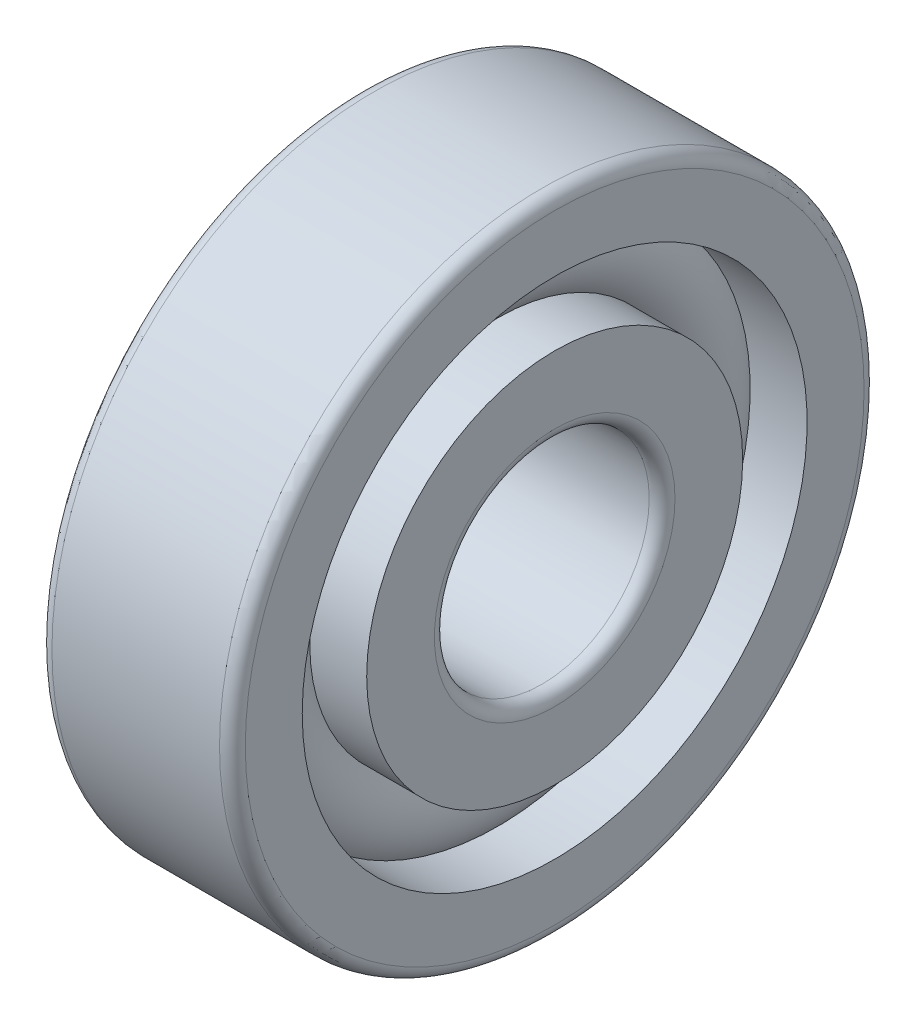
ISO-10303-21;
HEADER;
FILE_DESCRIPTION(('STEP AP214'),'2;1');
FILE_NAME('part.step','',(''),(''),'','','');
FILE_SCHEMA(('AUTOMOTIVE_DESIGN { 1 0 10303 214 1 1 1 1 }'));
ENDSEC;
DATA;
#1=APPLICATION_CONTEXT('core data for automotive mechanical design processes');
#2=APPLICATION_PROTOCOL_DEFINITION('international standard','automotive_design',2000,#1);
#3=PRODUCT_CONTEXT('',#1,'mechanical');
#4=PRODUCT('Part','Part','',(#3));
#5=PRODUCT_RELATED_PRODUCT_CATEGORY('part','',(#4));
#6=PRODUCT_DEFINITION_FORMATION('','',#4);
#7=PRODUCT_DEFINITION_CONTEXT('part definition',#1,'design');
#8=PRODUCT_DEFINITION('design','',#6,#7);
#9=PRODUCT_DEFINITION_SHAPE('','',#8);
#10=(LENGTH_UNIT() NAMED_UNIT(*) SI_UNIT(.MILLI.,.METRE.));
#11=(NAMED_UNIT(*) PLANE_ANGLE_UNIT() SI_UNIT($,.RADIAN.));
#12=(NAMED_UNIT(*) SI_UNIT($,.STERADIAN.) SOLID_ANGLE_UNIT());
#13=UNCERTAINTY_MEASURE_WITH_UNIT(LENGTH_MEASURE(1.E-05),#10,'distance_accuracy_value','');
#14=(GEOMETRIC_REPRESENTATION_CONTEXT(3) GLOBAL_UNCERTAINTY_ASSIGNED_CONTEXT((#13)) GLOBAL_UNIT_ASSIGNED_CONTEXT((#10,
#11,#12)) REPRESENTATION_CONTEXT('',''));
#15=CARTESIAN_POINT('',(0.,0.,0.));
#16=DIRECTION('',(0.,0.,1.));
#17=DIRECTION('',(1.,0.,0.));
#18=AXIS2_PLACEMENT_3D('',#15,#16,#17);
#19=CARTESIAN_POINT('',(1.50259452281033,0.,0.));
#20=DIRECTION('',(1.,0.,0.));
#21=DIRECTION('',(0.,0.,-1.));
#22=AXIS2_PLACEMENT_3D('',#19,#20,#21);
#23=TOROIDAL_SURFACE('',#22,11.8499999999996,0.099999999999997);
#24=CARTESIAN_POINT('',(1.40297711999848,0.,0.));
#25=DIRECTION('',(-1.,0.,0.));
#26=DIRECTION('',(0.,0.,1.));
#27=AXIS2_PLACEMENT_3D('',#24,#25,#26);
#28=CIRCLE('',#27,11.8412608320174);
#29=CARTESIAN_POINT('',(1.40297711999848,0.,11.8412608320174));
#30=VERTEX_POINT('',#29);
#31=EDGE_CURVE('E491',#30,#30,#28,.T.);
#32=ORIENTED_EDGE('',*,*,#31,.T.);
#33=EDGE_LOOP('',(#32));
#34=FACE_BOUND('',#33,.T.);
#35=CARTESIAN_POINT('',(1.50259425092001,0.,0.));
#36=DIRECTION('',(-1.,0.,0.));
#37=DIRECTION('',(0.,0.,1.));
#38=AXIS2_PLACEMENT_3D('',#35,#36,#37);
#39=CIRCLE('',#38,11.75);
#40=CARTESIAN_POINT('',(1.50259425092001,0.,11.75));
#41=VERTEX_POINT('',#40);
#42=EDGE_CURVE('E488',#41,#41,#39,.F.);
#43=ORIENTED_EDGE('',*,*,#42,.T.);
#44=EDGE_LOOP('',(#43));
#45=FACE_BOUND('',#44,.T.);
#46=ADVANCED_FACE('F14',(#34,#45),#23,.T.);
#47=CARTESIAN_POINT('',(1.383,0.,0.));
#48=DIRECTION('',(-1.,0.,0.));
#49=DIRECTION('',(0.,0.,1.));
#50=AXIS2_PLACEMENT_3D('',#47,#48,#49);
#51=CONICAL_SURFACE('',#50,12.069,1.48330098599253);
#52=CARTESIAN_POINT('',(1.383,0.,0.));
#53=DIRECTION('',(-1.,0.,0.));
#54=DIRECTION('',(0.,0.,1.));
#55=AXIS2_PLACEMENT_3D('',#52,#53,#54);
#56=CIRCLE('',#55,12.069);
#57=CARTESIAN_POINT('',(1.383,0.,12.069));
#58=VERTEX_POINT('',#57);
#59=EDGE_CURVE('E18',#58,#58,#56,.F.);
#60=ORIENTED_EDGE('',*,*,#59,.F.);
#61=EDGE_LOOP('',(#60));
#62=FACE_BOUND('',#61,.T.);
#63=ORIENTED_EDGE('',*,*,#31,.F.);
#64=EDGE_LOOP('',(#63));
#65=FACE_BOUND('',#64,.T.);
#66=ADVANCED_FACE('F426',(#62,#65),#51,.F.);
#67=CARTESIAN_POINT('',(8.4,0.,0.));
#68=DIRECTION('',(-1.,0.,0.));
#69=DIRECTION('',(0.,0.,1.));
#70=AXIS2_PLACEMENT_3D('',#67,#68,#69);
#71=CYLINDRICAL_SURFACE('',#70,11.75);
#72=ORIENTED_EDGE('',*,*,#42,.F.);
#73=EDGE_LOOP('',(#72));
#74=FACE_BOUND('',#73,.T.);
#75=CARTESIAN_POINT('',(2.65099999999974,0.,0.));
#76=DIRECTION('',(1.,0.,0.));
#77=DIRECTION('',(0.,0.,-1.));
#78=AXIS2_PLACEMENT_3D('',#75,#76,#77);
#79=CIRCLE('',#78,11.75);
#80=CARTESIAN_POINT('',(2.65099999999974,0.,-11.75));
#81=VERTEX_POINT('',#80);
#82=EDGE_CURVE('E411',#81,#81,#79,.F.);
#83=ORIENTED_EDGE('',*,*,#82,.F.);
#84=EDGE_LOOP('',(#83));
#85=FACE_BOUND('',#84,.T.);
#86=ADVANCED_FACE('F423',(#74,#85),#71,.F.);
#87=CARTESIAN_POINT('',(1.383,11.6,0.));
#88=DIRECTION('',(1.,0.,0.));
#89=DIRECTION('',(0.,0.,-1.));
#90=AXIS2_PLACEMENT_3D('',#87,#88,#89);
#91=PLANE('',#90);
#92=CARTESIAN_POINT('',(1.383,0.,0.));
#93=DIRECTION('',(1.,0.,0.));
#94=DIRECTION('',(0.,0.,-1.));
#95=AXIS2_PLACEMENT_3D('',#92,#93,#94);
#96=CIRCLE('',#95,11.6);
#97=CARTESIAN_POINT('',(1.383,0.,-11.6));
#98=VERTEX_POINT('',#97);
#99=EDGE_CURVE('E406',#98,#98,#96,.F.);
#100=ORIENTED_EDGE('',*,*,#99,.T.);
#101=EDGE_LOOP('',(#100));
#102=FACE_BOUND('',#101,.T.);
#103=ORIENTED_EDGE('',*,*,#59,.T.);
#104=EDGE_LOOP('',(#103));
#105=FACE_BOUND('',#104,.T.);
#106=ADVANCED_FACE('F419',(#102,#105),#91,.T.);
#107=CARTESIAN_POINT('',(4.50009734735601,0.,0.));
#108=DIRECTION('',(1.,0.,0.));
#109=DIRECTION('',(0.,0.,-1.));
#110=AXIS2_PLACEMENT_3D('',#107,#108,#109);
#111=TOROIDAL_SURFACE('',#110,10.25,2.381);
#112=ORIENTED_EDGE('',*,*,#82,.T.);
#113=EDGE_LOOP('',(#112));
#114=FACE_BOUND('',#113,.T.);
#115=CARTESIAN_POINT('',(2.65099999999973,0.,0.));
#116=DIRECTION('',(-1.,0.,0.));
#117=DIRECTION('',(0.,0.,1.));
#118=AXIS2_PLACEMENT_3D('',#115,#116,#117);
#119=CIRCLE('',#118,8.75);
#120=CARTESIAN_POINT('',(2.65099999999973,0.,8.75));
#121=VERTEX_POINT('',#120);
#122=EDGE_CURVE('E403',#121,#121,#119,.T.);
#123=ORIENTED_EDGE('',*,*,#122,.F.);
#124=EDGE_LOOP('',(#123));
#125=FACE_BOUND('',#124,.T.);
#126=ADVANCED_FACE('F414',(#114,#125),#111,.T.);
#127=CARTESIAN_POINT('',(1.383,0.,0.));
#128=DIRECTION('',(1.,0.,0.));
#129=DIRECTION('',(0.,0.,-1.));
#130=AXIS2_PLACEMENT_3D('',#127,#128,#129);
#131=CONICAL_SURFACE('',#130,11.6,0.785398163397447);
#132=CARTESIAN_POINT('',(0.633000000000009,0.,0.));
#133=DIRECTION('',(1.,0.,0.));
#134=DIRECTION('',(0.,0.,-1.));
#135=AXIS2_PLACEMENT_3D('',#132,#133,#134);
#136=CIRCLE('',#135,10.85);
#137=CARTESIAN_POINT('',(0.633000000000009,0.,-10.85));
#138=VERTEX_POINT('',#137);
#139=EDGE_CURVE('E400',#138,#138,#136,.T.);
#140=ORIENTED_EDGE('',*,*,#139,.F.);
#141=EDGE_LOOP('',(#140));
#142=FACE_BOUND('',#141,.T.);
#143=ORIENTED_EDGE('',*,*,#99,.F.);
#144=EDGE_LOOP('',(#143));
#145=FACE_BOUND('',#144,.T.);
#146=ADVANCED_FACE('F418',(#142,#145),#131,.F.);
#147=CARTESIAN_POINT('',(8.4,0.,0.));
#148=DIRECTION('',(-1.,0.,0.));
#149=DIRECTION('',(0.,0.,1.));
#150=AXIS2_PLACEMENT_3D('',#147,#148,#149);
#151=CYLINDRICAL_SURFACE('',#150,8.75);
#152=ORIENTED_EDGE('',*,*,#122,.T.);
#153=EDGE_LOOP('',(#152));
#154=FACE_BOUND('',#153,.T.);
#155=CARTESIAN_POINT('',(1.63808545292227,0.,0.));
#156=DIRECTION('',(1.,0.,0.));
#157=DIRECTION('',(0.,0.,-1.));
#158=AXIS2_PLACEMENT_3D('',#155,#156,#157);
#159=CIRCLE('',#158,8.75000000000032);
#160=CARTESIAN_POINT('',(1.63808545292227,0.,-8.75000000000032));
#161=VERTEX_POINT('',#160);
#162=EDGE_CURVE('E396',#161,#161,#159,.F.);
#163=ORIENTED_EDGE('',*,*,#162,.F.);
#164=EDGE_LOOP('',(#163));
#165=FACE_BOUND('',#164,.T.);
#166=ADVANCED_FACE('F506',(#154,#165),#151,.T.);
#167=CARTESIAN_POINT('',(0.63300000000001,8.55,0.));
#168=DIRECTION('',(1.,0.,0.));
#169=DIRECTION('',(0.,0.,-1.));
#170=AXIS2_PLACEMENT_3D('',#167,#168,#169);
#171=PLANE('',#170);
#172=CARTESIAN_POINT('',(0.633000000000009,0.,0.));
#173=DIRECTION('',(-1.,0.,0.));
#174=DIRECTION('',(0.,0.,1.));
#175=AXIS2_PLACEMENT_3D('',#172,#173,#174);
#176=CIRCLE('',#175,8.55);
#177=CARTESIAN_POINT('',(0.633000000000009,0.,8.55));
#178=VERTEX_POINT('',#177);
#179=EDGE_CURVE('E399',#178,#178,#176,.F.);
#180=ORIENTED_EDGE('',*,*,#179,.F.);
#181=EDGE_LOOP('',(#180));
#182=FACE_BOUND('',#181,.T.);
#183=ORIENTED_EDGE('',*,*,#139,.T.);
#184=EDGE_LOOP('',(#183));
#185=FACE_BOUND('',#184,.T.);
#186=ADVANCED_FACE('F388',(#182,#185),#171,.T.);
#187=CARTESIAN_POINT('',(1.63808545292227,0.,0.));
#188=DIRECTION('',(1.,0.,0.));
#189=DIRECTION('',(0.,0.,-1.));
#190=AXIS2_PLACEMENT_3D('',#187,#188,#189);
#191=TOROIDAL_SURFACE('',#190,8.55000000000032,0.2);
#192=ORIENTED_EDGE('',*,*,#162,.T.);
#193=EDGE_LOOP('',(#192));
#194=FACE_BOUND('',#193,.T.);
#195=CARTESIAN_POINT('',(1.45012673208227,0.,0.));
#196=DIRECTION('',(1.,0.,0.));
#197=DIRECTION('',(0.,0.,-1.));
#198=AXIS2_PLACEMENT_3D('',#195,#196,#197);
#199=CIRCLE('',#198,8.61834851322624);
#200=CARTESIAN_POINT('',(1.45012673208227,0.,-8.61834851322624));
#201=VERTEX_POINT('',#200);
#202=EDGE_CURVE('E479',#201,#201,#199,.F.);
#203=ORIENTED_EDGE('',*,*,#202,.F.);
#204=EDGE_LOOP('',(#203));
#205=FACE_BOUND('',#204,.T.);
#206=ADVANCED_FACE('F383',(#194,#205),#191,.T.);
#207=CARTESIAN_POINT('',(8.4,0.,0.));
#208=DIRECTION('',(-1.,0.,0.));
#209=DIRECTION('',(0.,0.,1.));
#210=AXIS2_PLACEMENT_3D('',#207,#208,#209);
#211=CYLINDRICAL_SURFACE('',#210,8.55);
#212=CARTESIAN_POINT('',(1.083,0.,0.));
#213=DIRECTION('',(-1.,0.,0.));
#214=DIRECTION('',(0.,0.,1.));
#215=AXIS2_PLACEMENT_3D('',#212,#213,#214);
#216=CIRCLE('',#215,8.55);
#217=CARTESIAN_POINT('',(1.083,0.,8.55));
#218=VERTEX_POINT('',#217);
#219=EDGE_CURVE('E476',#218,#218,#216,.F.);
#220=ORIENTED_EDGE('',*,*,#219,.F.);
#221=EDGE_LOOP('',(#220));
#222=FACE_BOUND('',#221,.T.);
#223=ORIENTED_EDGE('',*,*,#179,.T.);
#224=EDGE_LOOP('',(#223));
#225=FACE_BOUND('',#224,.T.);
#226=ADVANCED_FACE('F379',(#222,#225),#211,.T.);
#227=CARTESIAN_POINT('',(1.45012673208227,0.,0.));
#228=DIRECTION('',(1.,0.,0.));
#229=DIRECTION('',(0.,1.,0.));
#230=AXIS2_PLACEMENT_3D('',#227,#228,#229);
#231=CONICAL_SURFACE('',#230,8.61834851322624,1.22202532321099);
#232=ORIENTED_EDGE('',*,*,#202,.T.);
#233=EDGE_LOOP('',(#232));
#234=FACE_BOUND('',#233,.T.);
#235=CARTESIAN_POINT('',(1.1822369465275,0.,0.));
#236=DIRECTION('',(1.,0.,0.));
#237=DIRECTION('',(0.,0.,-1.));
#238=AXIS2_PLACEMENT_3D('',#235,#236,#237);
#239=CIRCLE('',#238,7.88165160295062);
#240=CARTESIAN_POINT('',(1.1822369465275,0.,-7.88165160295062));
#241=VERTEX_POINT('',#240);
#242=EDGE_CURVE('E364',#241,#241,#239,.T.);
#243=ORIENTED_EDGE('',*,*,#242,.T.);
#244=EDGE_LOOP('',(#243));
#245=FACE_BOUND('',#244,.T.);
#246=ADVANCED_FACE('F375',(#234,#245),#231,.T.);
#247=CARTESIAN_POINT('',(1.083,8.35,0.));
#248=DIRECTION('',(1.,0.,0.));
#249=DIRECTION('',(0.,0.,-1.));
#250=AXIS2_PLACEMENT_3D('',#247,#248,#249);
#251=PLANE('',#250);
#252=CARTESIAN_POINT('',(1.083,0.,0.));
#253=DIRECTION('',(-1.,0.,0.));
#254=DIRECTION('',(0.,0.,1.));
#255=AXIS2_PLACEMENT_3D('',#252,#253,#254);
#256=CIRCLE('',#255,8.35);
#257=CARTESIAN_POINT('',(1.083,0.,8.35));
#258=VERTEX_POINT('',#257);
#259=EDGE_CURVE('E359',#258,#258,#256,.T.);
#260=ORIENTED_EDGE('',*,*,#259,.T.);
#261=EDGE_LOOP('',(#260));
#262=FACE_BOUND('',#261,.T.);
#263=ORIENTED_EDGE('',*,*,#219,.T.);
#264=EDGE_LOOP('',(#263));
#265=FACE_BOUND('',#264,.T.);
#266=ADVANCED_FACE('F371',(#262,#265),#251,.T.);
#267=CARTESIAN_POINT('',(0.994278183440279,0.,0.));
#268=DIRECTION('',(1.,0.,0.));
#269=DIRECTION('',(0.,0.,-1.));
#270=AXIS2_PLACEMENT_3D('',#267,#268,#269);
#271=TOROIDAL_SURFACE('',#270,7.94999999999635,0.2);
#272=CARTESIAN_POINT('',(0.994279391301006,0.,0.));
#273=DIRECTION('',(-1.,0.,0.));
#274=DIRECTION('',(0.,0.,1.));
#275=AXIS2_PLACEMENT_3D('',#272,#273,#274);
#276=CIRCLE('',#275,7.75);
#277=CARTESIAN_POINT('',(0.994279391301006,0.,7.75));
#278=VERTEX_POINT('',#277);
#279=EDGE_CURVE('E346',#278,#278,#276,.T.);
#280=ORIENTED_EDGE('',*,*,#279,.F.);
#281=EDGE_LOOP('',(#280));
#282=FACE_BOUND('',#281,.T.);
#283=ORIENTED_EDGE('',*,*,#242,.F.);
#284=EDGE_LOOP('',(#283));
#285=FACE_BOUND('',#284,.T.);
#286=ADVANCED_FACE('F367',(#282,#285),#271,.F.);
#287=CARTESIAN_POINT('',(8.4,0.,0.));
#288=DIRECTION('',(-1.,0.,0.));
#289=DIRECTION('',(0.,0.,1.));
#290=AXIS2_PLACEMENT_3D('',#287,#288,#289);
#291=CYLINDRICAL_SURFACE('',#290,8.35);
#292=CARTESIAN_POINT('',(0.633000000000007,0.,0.));
#293=DIRECTION('',(1.,0.,0.));
#294=DIRECTION('',(0.,0.,-1.));
#295=AXIS2_PLACEMENT_3D('',#292,#293,#294);
#296=CIRCLE('',#295,8.35);
#297=CARTESIAN_POINT('',(0.633000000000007,0.,-8.35));
#298=VERTEX_POINT('',#297);
#299=EDGE_CURVE('E342',#298,#298,#296,.T.);
#300=ORIENTED_EDGE('',*,*,#299,.F.);
#301=EDGE_LOOP('',(#300));
#302=FACE_BOUND('',#301,.T.);
#303=ORIENTED_EDGE('',*,*,#259,.F.);
#304=EDGE_LOOP('',(#303));
#305=FACE_BOUND('',#304,.T.);
#306=ADVANCED_FACE('F370',(#302,#305),#291,.F.);
#307=CARTESIAN_POINT('',(8.4,0.,0.));
#308=DIRECTION('',(-1.,0.,0.));
#309=DIRECTION('',(0.,0.,1.));
#310=AXIS2_PLACEMENT_3D('',#307,#308,#309);
#311=CYLINDRICAL_SURFACE('',#310,7.75);
#312=ORIENTED_EDGE('',*,*,#279,.T.);
#313=EDGE_LOOP('',(#312));
#314=FACE_BOUND('',#313,.T.);
#315=CARTESIAN_POINT('',(0.928836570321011,0.,0.));
#316=DIRECTION('',(1.,0.,0.));
#317=DIRECTION('',(0.,0.,-1.));
#318=AXIS2_PLACEMENT_3D('',#315,#316,#317);
#319=CIRCLE('',#318,7.75);
#320=CARTESIAN_POINT('',(0.928836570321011,0.,-7.75));
#321=VERTEX_POINT('',#320);
#322=EDGE_CURVE('E345',#321,#321,#319,.T.);
#323=ORIENTED_EDGE('',*,*,#322,.T.);
#324=EDGE_LOOP('',(#323));
#325=FACE_BOUND('',#324,.T.);
#326=ADVANCED_FACE('F334',(#314,#325),#311,.T.);
#327=CARTESIAN_POINT('',(0.633000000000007,0.,0.));
#328=DIRECTION('',(1.,0.,0.));
#329=DIRECTION('',(0.,0.,-1.));
#330=AXIS2_PLACEMENT_3D('',#327,#328,#329);
#331=TOROIDAL_SURFACE('',#330,8.55,0.2);
#332=CARTESIAN_POINT('',(0.433000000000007,0.,0.));
#333=DIRECTION('',(-1.,0.,0.));
#334=DIRECTION('',(0.,0.,-1.));
#335=AXIS2_PLACEMENT_3D('',#332,#333,#334);
#336=CIRCLE('',#335,8.55);
#337=CARTESIAN_POINT('',(0.433000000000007,0.,-8.55));
#338=VERTEX_POINT('',#337);
#339=EDGE_CURVE('E299',#338,#338,#336,.F.);
#340=ORIENTED_EDGE('',*,*,#339,.F.);
#341=EDGE_LOOP('',(#340));
#342=FACE_BOUND('',#341,.T.);
#343=ORIENTED_EDGE('',*,*,#299,.T.);
#344=EDGE_LOOP('',(#343));
#345=FACE_BOUND('',#344,.T.);
#346=ADVANCED_FACE('F328',(#342,#345),#331,.T.);
#347=CARTESIAN_POINT('',(0.92883769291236,0.,0.));
#348=DIRECTION('',(1.,0.,0.));
#349=DIRECTION('',(0.,0.,-1.));
#350=AXIS2_PLACEMENT_3D('',#347,#348,#349);
#351=TOROIDAL_SURFACE('',#350,7.94999999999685,0.199999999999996);
#352=CARTESIAN_POINT('',(0.775613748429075,0.,0.));
#353=DIRECTION('',(-1.,0.,0.));
#354=DIRECTION('',(0.,0.,1.));
#355=AXIS2_PLACEMENT_3D('',#352,#353,#354);
#356=CIRCLE('',#355,7.82146042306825);
#357=CARTESIAN_POINT('',(0.775613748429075,0.,7.82146042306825));
#358=VERTEX_POINT('',#357);
#359=EDGE_CURVE('E296',#358,#358,#356,.T.);
#360=ORIENTED_EDGE('',*,*,#359,.F.);
#361=EDGE_LOOP('',(#360));
#362=FACE_BOUND('',#361,.T.);
#363=ORIENTED_EDGE('',*,*,#322,.F.);
#364=EDGE_LOOP('',(#363));
#365=FACE_BOUND('',#364,.T.);
#366=ADVANCED_FACE('F323',(#362,#365),#351,.F.);
#367=CARTESIAN_POINT('',(0.433000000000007,10.933,0.));
#368=DIRECTION('',(-1.,0.,0.));
#369=DIRECTION('',(0.,0.,1.));
#370=AXIS2_PLACEMENT_3D('',#367,#368,#369);
#371=PLANE('',#370);
#372=CARTESIAN_POINT('',(0.433000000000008,0.,0.));
#373=DIRECTION('',(1.,0.,0.));
#374=DIRECTION('',(0.,0.,-1.));
#375=AXIS2_PLACEMENT_3D('',#372,#373,#374);
#376=CIRCLE('',#375,10.933);
#377=CARTESIAN_POINT('',(0.433000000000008,0.,-10.933));
#378=VERTEX_POINT('',#377);
#379=EDGE_CURVE('E293',#378,#378,#376,.T.);
#380=ORIENTED_EDGE('',*,*,#379,.F.);
#381=EDGE_LOOP('',(#380));
#382=FACE_BOUND('',#381,.T.);
#383=ORIENTED_EDGE('',*,*,#339,.T.);
#384=EDGE_LOOP('',(#383));
#385=FACE_BOUND('',#384,.T.);
#386=ADVANCED_FACE('F312',(#382,#385),#371,.T.);
#387=CARTESIAN_POINT('',(0.5,0.,0.));
#388=DIRECTION('',(-1.,0.,0.));
#389=DIRECTION('',(0.,-1.,0.));
#390=AXIS2_PLACEMENT_3D('',#387,#388,#389);
#391=CONICAL_SURFACE('',#390,8.15,0.872778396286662);
#392=ORIENTED_EDGE('',*,*,#359,.T.);
#393=EDGE_LOOP('',(#392));
#394=FACE_BOUND('',#393,.T.);
#395=CARTESIAN_POINT('',(0.5,0.,0.));
#396=DIRECTION('',(-1.,0.,0.));
#397=DIRECTION('',(0.,0.,1.));
#398=AXIS2_PLACEMENT_3D('',#395,#396,#397);
#399=CIRCLE('',#398,8.15);
#400=CARTESIAN_POINT('',(0.5,0.,8.15));
#401=VERTEX_POINT('',#400);
#402=EDGE_CURVE('E288',#401,#401,#399,.T.);
#403=ORIENTED_EDGE('',*,*,#402,.F.);
#404=EDGE_LOOP('',(#403));
#405=FACE_BOUND('',#404,.T.);
#406=ADVANCED_FACE('F322',(#394,#405),#391,.T.);
#407=CARTESIAN_POINT('',(1.183,0.,0.));
#408=DIRECTION('',(1.,0.,0.));
#409=DIRECTION('',(0.,0.,-1.));
#410=AXIS2_PLACEMENT_3D('',#407,#408,#409);
#411=CONICAL_SURFACE('',#410,11.683,0.785398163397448);
#412=CARTESIAN_POINT('',(1.183,0.,0.));
#413=DIRECTION('',(-1.,0.,0.));
#414=DIRECTION('',(0.,0.,1.));
#415=AXIS2_PLACEMENT_3D('',#412,#413,#414);
#416=CIRCLE('',#415,11.683);
#417=CARTESIAN_POINT('',(1.183,0.,11.683));
#418=VERTEX_POINT('',#417);
#419=EDGE_CURVE('E271',#418,#418,#416,.T.);
#420=ORIENTED_EDGE('',*,*,#419,.T.);
#421=EDGE_LOOP('',(#420));
#422=FACE_BOUND('',#421,.T.);
#423=ORIENTED_EDGE('',*,*,#379,.T.);
#424=EDGE_LOOP('',(#423));
#425=FACE_BOUND('',#424,.T.);
#426=ADVANCED_FACE('F684',(#422,#425),#411,.T.);
#427=CARTESIAN_POINT('',(8.4,0.,0.));
#428=DIRECTION('',(-1.,0.,0.));
#429=DIRECTION('',(0.,0.,1.));
#430=AXIS2_PLACEMENT_3D('',#427,#428,#429);
#431=CYLINDRICAL_SURFACE('',#430,8.15);
#432=ORIENTED_EDGE('',*,*,#402,.T.);
#433=EDGE_LOOP('',(#432));
#434=FACE_BOUND('',#433,.T.);
#435=CARTESIAN_POINT('',(0.2,0.,0.));
#436=DIRECTION('',(1.,0.,0.));
#437=DIRECTION('',(0.,0.,-1.));
#438=AXIS2_PLACEMENT_3D('',#435,#436,#437);
#439=CIRCLE('',#438,8.15);
#440=CARTESIAN_POINT('',(0.2,0.,-8.15));
#441=VERTEX_POINT('',#440);
#442=EDGE_CURVE('E268',#441,#441,#439,.F.);
#443=ORIENTED_EDGE('',*,*,#442,.F.);
#444=EDGE_LOOP('',(#443));
#445=FACE_BOUND('',#444,.T.);
#446=ADVANCED_FACE('F674',(#434,#445),#431,.T.);
#447=CARTESIAN_POINT('',(1.13998897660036,0.,0.));
#448=DIRECTION('',(-1.,0.,0.));
#449=DIRECTION('',(0.,0.,1.));
#450=AXIS2_PLACEMENT_3D('',#447,#448,#449);
#451=CONICAL_SURFACE('',#450,12.5602248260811,1.52180477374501);
#452=CARTESIAN_POINT('',(1.13998897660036,0.,0.));
#453=DIRECTION('',(1.,0.,0.));
#454=DIRECTION('',(0.,0.,-1.));
#455=AXIS2_PLACEMENT_3D('',#452,#453,#454);
#456=CIRCLE('',#455,12.5602248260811);
#457=CARTESIAN_POINT('',(1.13998897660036,0.,-12.5602248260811));
#458=VERTEX_POINT('',#457);
#459=EDGE_CURVE('E247',#458,#458,#456,.F.);
#460=ORIENTED_EDGE('',*,*,#459,.T.);
#461=EDGE_LOOP('',(#460));
#462=FACE_BOUND('',#461,.T.);
#463=ORIENTED_EDGE('',*,*,#419,.F.);
#464=EDGE_LOOP('',(#463));
#465=FACE_BOUND('',#464,.T.);
#466=ADVANCED_FACE('F261',(#462,#465),#451,.F.);
#467=CARTESIAN_POINT('',(0.2,0.,0.));
#468=DIRECTION('',(1.,0.,0.));
#469=DIRECTION('',(0.,0.,-1.));
#470=AXIS2_PLACEMENT_3D('',#467,#468,#469);
#471=TOROIDAL_SURFACE('',#470,7.95,0.2);
#472=ORIENTED_EDGE('',*,*,#442,.T.);
#473=EDGE_LOOP('',(#472));
#474=FACE_BOUND('',#473,.T.);
#475=CARTESIAN_POINT('',(0.,0.,0.));
#476=DIRECTION('',(1.,0.,0.));
#477=DIRECTION('',(0.,0.,-1.));
#478=AXIS2_PLACEMENT_3D('',#475,#476,#477);
#479=CIRCLE('',#478,7.95000000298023);
#480=CARTESIAN_POINT('',(0.,0.,-7.95000000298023));
#481=VERTEX_POINT('',#480);
#482=EDGE_CURVE('E277',#481,#481,#479,.F.);
#483=ORIENTED_EDGE('',*,*,#482,.F.);
#484=EDGE_LOOP('',(#483));
#485=FACE_BOUND('',#484,.T.);
#486=ADVANCED_FACE('F254',(#474,#485),#471,.T.);
#487=CARTESIAN_POINT('',(1.04010919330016,0.,0.));
#488=DIRECTION('',(1.,0.,0.));
#489=DIRECTION('',(0.,0.,-1.));
#490=AXIS2_PLACEMENT_3D('',#487,#488,#489);
#491=TOROIDAL_SURFACE('',#490,12.5553228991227,0.1);
#492=ORIENTED_EDGE('',*,*,#459,.F.);
#493=EDGE_LOOP('',(#492));
#494=FACE_BOUND('',#493,.T.);
#495=CARTESIAN_POINT('',(0.96350055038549,0.,0.));
#496=DIRECTION('',(1.,0.,0.));
#497=DIRECTION('',(0.,0.,-1.));
#498=AXIS2_PLACEMENT_3D('',#495,#496,#497);
#499=CIRCLE('',#498,12.6195966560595);
#500=CARTESIAN_POINT('',(0.96350055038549,0.,-12.6195966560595));
#501=VERTEX_POINT('',#500);
#502=EDGE_CURVE('E221',#501,#501,#499,.F.);
#503=ORIENTED_EDGE('',*,*,#502,.T.);
#504=EDGE_LOOP('',(#503));
#505=FACE_BOUND('',#504,.T.);
#506=ADVANCED_FACE('F250',(#494,#505),#491,.F.);
#507=CARTESIAN_POINT('',(0.,7.95,0.));
#508=DIRECTION('',(-1.,0.,0.));
#509=DIRECTION('',(0.,0.,1.));
#510=AXIS2_PLACEMENT_3D('',#507,#508,#509);
#511=PLANE('',#510);
#512=ORIENTED_EDGE('',*,*,#482,.T.);
#513=EDGE_LOOP('',(#512));
#514=FACE_BOUND('',#513,.T.);
#515=CARTESIAN_POINT('',(0.,0.,0.));
#516=DIRECTION('',(-1.,0.,0.));
#517=DIRECTION('',(0.,0.,-1.));
#518=AXIS2_PLACEMENT_3D('',#515,#516,#517);
#519=CIRCLE('',#518,5.6);
#520=CARTESIAN_POINT('',(0.,0.,-5.6));
#521=VERTEX_POINT('',#520);
#522=EDGE_CURVE('E216',#521,#521,#519,.T.);
#523=ORIENTED_EDGE('',*,*,#522,.F.);
#524=EDGE_LOOP('',(#523));
#525=FACE_BOUND('',#524,.T.);
#526=ADVANCED_FACE('F253',(#514,#525),#511,.T.);
#527=CARTESIAN_POINT('',(0.96350055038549,0.,0.));
#528=DIRECTION('',(1.,0.,0.));
#529=DIRECTION('',(0.,0.,-1.));
#530=AXIS2_PLACEMENT_3D('',#527,#528,#529);
#531=CONICAL_SURFACE('',#530,12.6195966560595,0.872766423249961);
#532=CARTESIAN_POINT('',(0.713000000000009,0.,0.));
#533=DIRECTION('',(-1.,0.,0.));
#534=DIRECTION('',(0.,0.,1.));
#535=AXIS2_PLACEMENT_3D('',#532,#533,#534);
#536=CIRCLE('',#535,12.321);
#537=CARTESIAN_POINT('',(0.713000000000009,0.,12.321));
#538=VERTEX_POINT('',#537);
#539=EDGE_CURVE('E211',#538,#538,#536,.F.);
#540=ORIENTED_EDGE('',*,*,#539,.F.);
#541=EDGE_LOOP('',(#540));
#542=FACE_BOUND('',#541,.T.);
#543=ORIENTED_EDGE('',*,*,#502,.F.);
#544=EDGE_LOOP('',(#543));
#545=FACE_BOUND('',#544,.T.);
#546=ADVANCED_FACE('F230',(#542,#545),#531,.F.);
#547=CARTESIAN_POINT('',(0.6,0.,0.));
#548=DIRECTION('',(1.,0.,0.));
#549=DIRECTION('',(0.,0.,-1.));
#550=AXIS2_PLACEMENT_3D('',#547,#548,#549);
#551=TOROIDAL_SURFACE('',#550,5.6,0.6);
#552=ORIENTED_EDGE('',*,*,#522,.T.);
#553=EDGE_LOOP('',(#552));
#554=FACE_BOUND('',#553,.T.);
#555=CARTESIAN_POINT('',(0.6,0.,0.));
#556=DIRECTION('',(-1.,0.,0.));
#557=DIRECTION('',(0.,0.,1.));
#558=AXIS2_PLACEMENT_3D('',#555,#556,#557);
#559=CIRCLE('',#558,5.);
#560=CARTESIAN_POINT('',(0.6,0.,5.));
#561=VERTEX_POINT('',#560);
#562=EDGE_CURVE('E206',#561,#561,#559,.F.);
#563=ORIENTED_EDGE('',*,*,#562,.T.);
#564=EDGE_LOOP('',(#563));
#565=FACE_BOUND('',#564,.T.);
#566=ADVANCED_FACE('F224',(#554,#565),#551,.T.);
#567=CARTESIAN_POINT('',(0.713000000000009,0.,0.));
#568=DIRECTION('',(-1.,0.,0.));
#569=DIRECTION('',(0.,0.,1.));
#570=AXIS2_PLACEMENT_3D('',#567,#568,#569);
#571=CONICAL_SURFACE('',#570,12.321,0.696663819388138);
#572=CARTESIAN_POINT('',(0.866000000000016,0.,0.));
#573=DIRECTION('',(1.,0.,0.));
#574=DIRECTION('',(0.,0.,-1.));
#575=AXIS2_PLACEMENT_3D('',#572,#573,#574);
#576=CIRCLE('',#575,12.193);
#577=CARTESIAN_POINT('',(0.866000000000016,0.,-12.193));
#578=VERTEX_POINT('',#577);
#579=EDGE_CURVE('E198',#578,#578,#576,.F.);
#580=ORIENTED_EDGE('',*,*,#579,.T.);
#581=EDGE_LOOP('',(#580));
#582=FACE_BOUND('',#581,.T.);
#583=ORIENTED_EDGE('',*,*,#539,.T.);
#584=EDGE_LOOP('',(#583));
#585=FACE_BOUND('',#584,.T.);
#586=ADVANCED_FACE('F229',(#582,#585),#571,.T.);
#587=CARTESIAN_POINT('',(8.4,0.,0.));
#588=DIRECTION('',(-1.,0.,0.));
#589=DIRECTION('',(0.,0.,1.));
#590=AXIS2_PLACEMENT_3D('',#587,#588,#589);
#591=CYLINDRICAL_SURFACE('',#590,5.);
#592=ORIENTED_EDGE('',*,*,#562,.F.);
#593=EDGE_LOOP('',(#592));
#594=FACE_BOUND('',#593,.T.);
#595=CARTESIAN_POINT('',(8.4,0.,0.));
#596=DIRECTION('',(1.,0.,0.));
#597=DIRECTION('',(0.,0.,-1.));
#598=AXIS2_PLACEMENT_3D('',#595,#596,#597);
#599=CIRCLE('',#598,5.);
#600=CARTESIAN_POINT('',(8.4,0.,-5.));
#601=VERTEX_POINT('',#600);
#602=EDGE_CURVE('E179',#601,#601,#599,.F.);
#603=ORIENTED_EDGE('',*,*,#602,.F.);
#604=EDGE_LOOP('',(#603));
#605=FACE_BOUND('',#604,.T.);
#606=ADVANCED_FACE('F609',(#594,#605),#591,.F.);
#607=CARTESIAN_POINT('',(0.866000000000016,0.,0.));
#608=DIRECTION('',(1.,0.,0.));
#609=DIRECTION('',(0.,0.,-1.));
#610=AXIS2_PLACEMENT_3D('',#607,#608,#609);
#611=CONICAL_SURFACE('',#610,12.193,0.874132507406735);
#612=CARTESIAN_POINT('',(0.738,0.,0.));
#613=DIRECTION('',(-1.,0.,0.));
#614=DIRECTION('',(0.,0.,1.));
#615=AXIS2_PLACEMENT_3D('',#612,#613,#614);
#616=CIRCLE('',#615,12.04);
#617=CARTESIAN_POINT('',(0.738,0.,12.04));
#618=VERTEX_POINT('',#617);
#619=EDGE_CURVE('E170',#618,#618,#616,.T.);
#620=ORIENTED_EDGE('',*,*,#619,.T.);
#621=EDGE_LOOP('',(#620));
#622=FACE_BOUND('',#621,.T.);
#623=ORIENTED_EDGE('',*,*,#579,.F.);
#624=EDGE_LOOP('',(#623));
#625=FACE_BOUND('',#624,.T.);
#626=ADVANCED_FACE('F189',(#622,#625),#611,.F.);
#627=CARTESIAN_POINT('',(8.4,0.,0.));
#628=DIRECTION('',(1.,0.,0.));
#629=DIRECTION('',(0.,0.,-1.));
#630=AXIS2_PLACEMENT_3D('',#627,#628,#629);
#631=TOROIDAL_SURFACE('',#630,5.6,0.6);
#632=ORIENTED_EDGE('',*,*,#602,.T.);
#633=EDGE_LOOP('',(#632));
#634=FACE_BOUND('',#633,.T.);
#635=CARTESIAN_POINT('',(9.,0.,0.));
#636=DIRECTION('',(1.,0.,0.));
#637=DIRECTION('',(0.,0.,-1.));
#638=AXIS2_PLACEMENT_3D('',#635,#636,#637);
#639=CIRCLE('',#638,5.6);
#640=CARTESIAN_POINT('',(9.,0.,-5.6));
#641=VERTEX_POINT('',#640);
#642=EDGE_CURVE('E178',#641,#641,#639,.F.);
#643=ORIENTED_EDGE('',*,*,#642,.F.);
#644=EDGE_LOOP('',(#643));
#645=FACE_BOUND('',#644,.T.);
#646=ADVANCED_FACE('F185',(#634,#645),#631,.T.);
#647=CARTESIAN_POINT('',(0.584905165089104,0.,0.));
#648=DIRECTION('',(-1.,0.,0.));
#649=DIRECTION('',(0.,0.,1.));
#650=AXIS2_PLACEMENT_3D('',#647,#648,#649);
#651=CONICAL_SURFACE('',#650,12.1680793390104,0.696663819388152);
#652=CARTESIAN_POINT('',(0.584905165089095,0.,0.));
#653=DIRECTION('',(1.,0.,0.));
#654=DIRECTION('',(0.,0.,-1.));
#655=AXIS2_PLACEMENT_3D('',#652,#653,#654);
#656=CIRCLE('',#655,12.1680793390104);
#657=CARTESIAN_POINT('',(0.584905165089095,0.,-12.1680793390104));
#658=VERTEX_POINT('',#657);
#659=EDGE_CURVE('E148',#658,#658,#656,.T.);
#660=ORIENTED_EDGE('',*,*,#659,.F.);
#661=EDGE_LOOP('',(#660));
#662=FACE_BOUND('',#661,.T.);
#663=ORIENTED_EDGE('',*,*,#619,.F.);
#664=EDGE_LOOP('',(#663));
#665=FACE_BOUND('',#664,.T.);
#666=ADVANCED_FACE('F161',(#662,#665),#651,.F.);
#667=CARTESIAN_POINT('',(9.,5.6,0.));
#668=DIRECTION('',(1.,0.,0.));
#669=DIRECTION('',(0.,0.,-1.));
#670=AXIS2_PLACEMENT_3D('',#667,#668,#669);
#671=PLANE('',#670);
#672=ORIENTED_EDGE('',*,*,#642,.T.);
#673=EDGE_LOOP('',(#672));
#674=FACE_BOUND('',#673,.T.);
#675=CARTESIAN_POINT('',(9.,0.,0.));
#676=DIRECTION('',(-1.,0.,0.));
#677=DIRECTION('',(0.,0.,1.));
#678=AXIS2_PLACEMENT_3D('',#675,#676,#677);
#679=CIRCLE('',#678,8.75);
#680=CARTESIAN_POINT('',(9.,0.,8.75));
#681=VERTEX_POINT('',#680);
#682=EDGE_CURVE('E143',#681,#681,#679,.T.);
#683=ORIENTED_EDGE('',*,*,#682,.F.);
#684=EDGE_LOOP('',(#683));
#685=FACE_BOUND('',#684,.T.);
#686=ADVANCED_FACE('F156',(#674,#685),#671,.T.);
#687=CARTESIAN_POINT('',(0.713237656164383,0.,0.));
#688=DIRECTION('',(1.,0.,0.));
#689=DIRECTION('',(0.,0.,-1.));
#690=AXIS2_PLACEMENT_3D('',#687,#688,#689);
#691=TOROIDAL_SURFACE('',#690,12.3214767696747,0.2);
#692=CARTESIAN_POINT('',(0.559999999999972,0.,0.));
#693=DIRECTION('',(-1.,0.,0.));
#694=DIRECTION('',(0.,0.,1.));
#695=AXIS2_PLACEMENT_3D('',#692,#693,#694);
#696=CIRCLE('',#695,12.45);
#697=CARTESIAN_POINT('',(0.559999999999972,0.,12.45));
#698=VERTEX_POINT('',#697);
#699=EDGE_CURVE('E138',#698,#698,#696,.T.);
#700=ORIENTED_EDGE('',*,*,#699,.T.);
#701=EDGE_LOOP('',(#700));
#702=FACE_BOUND('',#701,.T.);
#703=ORIENTED_EDGE('',*,*,#659,.T.);
#704=EDGE_LOOP('',(#703));
#705=FACE_BOUND('',#704,.T.);
#706=ADVANCED_FACE('F151',(#702,#705),#691,.T.);
#707=CARTESIAN_POINT('',(8.4,0.,0.));
#708=DIRECTION('',(-1.,0.,0.));
#709=DIRECTION('',(0.,0.,1.));
#710=AXIS2_PLACEMENT_3D('',#707,#708,#709);
#711=CYLINDRICAL_SURFACE('',#710,8.75);
#712=ORIENTED_EDGE('',*,*,#682,.T.);
#713=EDGE_LOOP('',(#712));
#714=FACE_BOUND('',#713,.T.);
#715=CARTESIAN_POINT('',(6.35000000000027,0.,0.));
#716=DIRECTION('',(1.,0.,0.));
#717=DIRECTION('',(0.,0.,-1.));
#718=AXIS2_PLACEMENT_3D('',#715,#716,#717);
#719=CIRCLE('',#718,8.75);
#720=CARTESIAN_POINT('',(6.35000000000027,0.,-8.75));
#721=VERTEX_POINT('',#720);
#722=EDGE_CURVE('E135',#721,#721,#719,.F.);
#723=ORIENTED_EDGE('',*,*,#722,.F.);
#724=EDGE_LOOP('',(#723));
#725=FACE_BOUND('',#724,.T.);
#726=ADVANCED_FACE('F155',(#714,#725),#711,.T.);
#727=CARTESIAN_POINT('',(8.4,0.,0.));
#728=DIRECTION('',(-1.,0.,0.));
#729=DIRECTION('',(0.,0.,1.));
#730=AXIS2_PLACEMENT_3D('',#727,#728,#729);
#731=CYLINDRICAL_SURFACE('',#730,12.45);
#732=CARTESIAN_POINT('',(0.1,0.,0.));
#733=DIRECTION('',(1.,0.,0.));
#734=DIRECTION('',(0.,0.,-1.));
#735=AXIS2_PLACEMENT_3D('',#732,#733,#734);
#736=CIRCLE('',#735,12.45);
#737=CARTESIAN_POINT('',(0.1,0.,-12.45));
#738=VERTEX_POINT('',#737);
#739=EDGE_CURVE('E110',#738,#738,#736,.T.);
#740=ORIENTED_EDGE('',*,*,#739,.F.);
#741=EDGE_LOOP('',(#740));
#742=FACE_BOUND('',#741,.T.);
#743=ORIENTED_EDGE('',*,*,#699,.F.);
#744=EDGE_LOOP('',(#743));
#745=FACE_BOUND('',#744,.T.);
#746=ADVANCED_FACE('F582',(#742,#745),#731,.F.);
#747=CARTESIAN_POINT('',(4.500902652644,0.,0.));
#748=DIRECTION('',(1.,0.,0.));
#749=DIRECTION('',(0.,0.,-1.));
#750=AXIS2_PLACEMENT_3D('',#747,#748,#749);
#751=TOROIDAL_SURFACE('',#750,10.25,2.381);
#752=ORIENTED_EDGE('',*,*,#722,.T.);
#753=EDGE_LOOP('',(#752));
#754=FACE_BOUND('',#753,.T.);
#755=CARTESIAN_POINT('',(6.35000000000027,0.,0.));
#756=DIRECTION('',(-1.,0.,0.));
#757=DIRECTION('',(0.,0.,1.));
#758=AXIS2_PLACEMENT_3D('',#755,#756,#757);
#759=CIRCLE('',#758,11.75);
#760=CARTESIAN_POINT('',(6.35000000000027,0.,11.75));
#761=VERTEX_POINT('',#760);
#762=EDGE_CURVE('E102',#761,#761,#759,.F.);
#763=ORIENTED_EDGE('',*,*,#762,.T.);
#764=EDGE_LOOP('',(#763));
#765=FACE_BOUND('',#764,.T.);
#766=ADVANCED_FACE('F120',(#754,#765),#751,.T.);
#767=CARTESIAN_POINT('',(0.1,0.,0.));
#768=DIRECTION('',(1.,0.,0.));
#769=DIRECTION('',(0.,0.,-1.));
#770=AXIS2_PLACEMENT_3D('',#767,#768,#769);
#771=TOROIDAL_SURFACE('',#770,12.55,0.1);
#772=CARTESIAN_POINT('',(0.,0.,0.));
#773=DIRECTION('',(-1.,0.,0.));
#774=DIRECTION('',(0.,0.,-1.));
#775=AXIS2_PLACEMENT_3D('',#772,#773,#774);
#776=CIRCLE('',#775,12.55);
#777=CARTESIAN_POINT('',(0.,0.,-12.55));
#778=VERTEX_POINT('',#777);
#779=EDGE_CURVE('E65',#778,#778,#776,.F.);
#780=ORIENTED_EDGE('',*,*,#779,.F.);
#781=EDGE_LOOP('',(#780));
#782=FACE_BOUND('',#781,.T.);
#783=ORIENTED_EDGE('',*,*,#739,.T.);
#784=EDGE_LOOP('',(#783));
#785=FACE_BOUND('',#784,.T.);
#786=ADVANCED_FACE('F116',(#782,#785),#771,.T.);
#787=CARTESIAN_POINT('',(8.4,0.,0.));
#788=DIRECTION('',(-1.,0.,0.));
#789=DIRECTION('',(0.,0.,1.));
#790=AXIS2_PLACEMENT_3D('',#787,#788,#789);
#791=CYLINDRICAL_SURFACE('',#790,11.75);
#792=ORIENTED_EDGE('',*,*,#762,.F.);
#793=EDGE_LOOP('',(#792));
#794=FACE_BOUND('',#793,.T.);
#795=CARTESIAN_POINT('',(9.,0.,0.));
#796=DIRECTION('',(-1.,0.,0.));
#797=DIRECTION('',(0.,0.,1.));
#798=AXIS2_PLACEMENT_3D('',#795,#796,#797);
#799=CIRCLE('',#798,11.75);
#800=CARTESIAN_POINT('',(9.,0.,11.75));
#801=VERTEX_POINT('',#800);
#802=EDGE_CURVE('E457',#801,#801,#799,.T.);
#803=ORIENTED_EDGE('',*,*,#802,.F.);
#804=EDGE_LOOP('',(#803));
#805=FACE_BOUND('',#804,.T.);
#806=ADVANCED_FACE('F82',(#794,#805),#791,.F.);
#807=CARTESIAN_POINT('',(0.,14.4,0.));
#808=DIRECTION('',(-1.,0.,0.));
#809=DIRECTION('',(0.,0.,1.));
#810=AXIS2_PLACEMENT_3D('',#807,#808,#809);
#811=PLANE('',#810);
#812=CARTESIAN_POINT('',(0.,0.,0.));
#813=DIRECTION('',(1.,0.,0.));
#814=DIRECTION('',(0.,0.,-1.));
#815=AXIS2_PLACEMENT_3D('',#812,#813,#814);
#816=CIRCLE('',#815,14.4);
#817=CARTESIAN_POINT('',(0.,0.,-14.4));
#818=VERTEX_POINT('',#817);
#819=EDGE_CURVE('E98',#818,#818,#816,.T.);
#820=ORIENTED_EDGE('',*,*,#819,.F.);
#821=EDGE_LOOP('',(#820));
#822=FACE_BOUND('',#821,.T.);
#823=ORIENTED_EDGE('',*,*,#779,.T.);
#824=EDGE_LOOP('',(#823));
#825=FACE_BOUND('',#824,.T.);
#826=ADVANCED_FACE('F72',(#822,#825),#811,.T.);
#827=CARTESIAN_POINT('',(9.,11.75,0.));
#828=DIRECTION('',(1.,0.,0.));
#829=DIRECTION('',(0.,0.,-1.));
#830=AXIS2_PLACEMENT_3D('',#827,#828,#829);
#831=PLANE('',#830);
#832=ORIENTED_EDGE('',*,*,#802,.T.);
#833=EDGE_LOOP('',(#832));
#834=FACE_BOUND('',#833,.T.);
#835=CARTESIAN_POINT('',(9.,0.,0.));
#836=DIRECTION('',(-1.,0.,0.));
#837=DIRECTION('',(0.,0.,-1.));
#838=AXIS2_PLACEMENT_3D('',#835,#836,#837);
#839=CIRCLE('',#838,14.4);
#840=CARTESIAN_POINT('',(9.,0.,-14.4));
#841=VERTEX_POINT('',#840);
#842=EDGE_CURVE('E27',#841,#841,#839,.T.);
#843=ORIENTED_EDGE('',*,*,#842,.F.);
#844=EDGE_LOOP('',(#843));
#845=FACE_BOUND('',#844,.T.);
#846=ADVANCED_FACE('F81',(#834,#845),#831,.T.);
#847=CARTESIAN_POINT('',(0.6,0.,0.));
#848=DIRECTION('',(1.,0.,0.));
#849=DIRECTION('',(0.,0.,-1.));
#850=AXIS2_PLACEMENT_3D('',#847,#848,#849);
#851=TOROIDAL_SURFACE('',#850,14.4,0.6);
#852=CARTESIAN_POINT('',(0.600000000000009,0.,0.));
#853=DIRECTION('',(-1.,0.,0.));
#854=DIRECTION('',(0.,0.,1.));
#855=AXIS2_PLACEMENT_3D('',#852,#853,#854);
#856=CIRCLE('',#855,15.);
#857=CARTESIAN_POINT('',(0.600000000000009,0.,15.));
#858=VERTEX_POINT('',#857);
#859=EDGE_CURVE('E22',#858,#858,#856,.F.);
#860=ORIENTED_EDGE('',*,*,#859,.F.);
#861=EDGE_LOOP('',(#860));
#862=FACE_BOUND('',#861,.T.);
#863=ORIENTED_EDGE('',*,*,#819,.T.);
#864=EDGE_LOOP('',(#863));
#865=FACE_BOUND('',#864,.T.);
#866=ADVANCED_FACE('F45',(#862,#865),#851,.T.);
#867=CARTESIAN_POINT('',(8.4,0.,0.));
#868=DIRECTION('',(1.,0.,0.));
#869=DIRECTION('',(0.,0.,-1.));
#870=AXIS2_PLACEMENT_3D('',#867,#868,#869);
#871=TOROIDAL_SURFACE('',#870,14.4,0.6);
#872=ORIENTED_EDGE('',*,*,#842,.T.);
#873=EDGE_LOOP('',(#872));
#874=FACE_BOUND('',#873,.T.);
#875=CARTESIAN_POINT('',(8.4,0.,0.));
#876=DIRECTION('',(-1.,0.,0.));
#877=DIRECTION('',(0.,0.,1.));
#878=AXIS2_PLACEMENT_3D('',#875,#876,#877);
#879=CIRCLE('',#878,15.);
#880=CARTESIAN_POINT('',(8.4,0.,15.));
#881=VERTEX_POINT('',#880);
#882=EDGE_CURVE('E10',#881,#881,#879,.T.);
#883=ORIENTED_EDGE('',*,*,#882,.F.);
#884=EDGE_LOOP('',(#883));
#885=FACE_BOUND('',#884,.T.);
#886=ADVANCED_FACE('F39',(#874,#885),#871,.T.);
#887=CARTESIAN_POINT('',(8.4,0.,0.));
#888=DIRECTION('',(-1.,0.,0.));
#889=DIRECTION('',(0.,0.,1.));
#890=AXIS2_PLACEMENT_3D('',#887,#888,#889);
#891=CYLINDRICAL_SURFACE('',#890,15.);
#892=ORIENTED_EDGE('',*,*,#882,.T.);
#893=EDGE_LOOP('',(#892));
#894=FACE_BOUND('',#893,.T.);
#895=ORIENTED_EDGE('',*,*,#859,.T.);
#896=EDGE_LOOP('',(#895));
#897=FACE_BOUND('',#896,.T.);
#898=ADVANCED_FACE('F44',(#894,#897),#891,.T.);
#899=CLOSED_SHELL('',(#46,#66,#86,#106,#126,#146,#166,#186,#206,#226,#246,#266,#286,#306,#326,
#346,#366,#386,#406,#426,#446,#466,#486,#506,#526,#546,#566,#586,#606,#626,#646,#666,#686,#706,
#726,#746,#766,#786,#806,#826,#846,#866,#886,#898));
#900=MANIFOLD_SOLID_BREP('B1',#899);
#901=ADVANCED_BREP_SHAPE_REPRESENTATION('',(#18,#900),#14);
#902=SHAPE_DEFINITION_REPRESENTATION(#9,#901);
ENDSEC;
END-ISO-10303-21;
